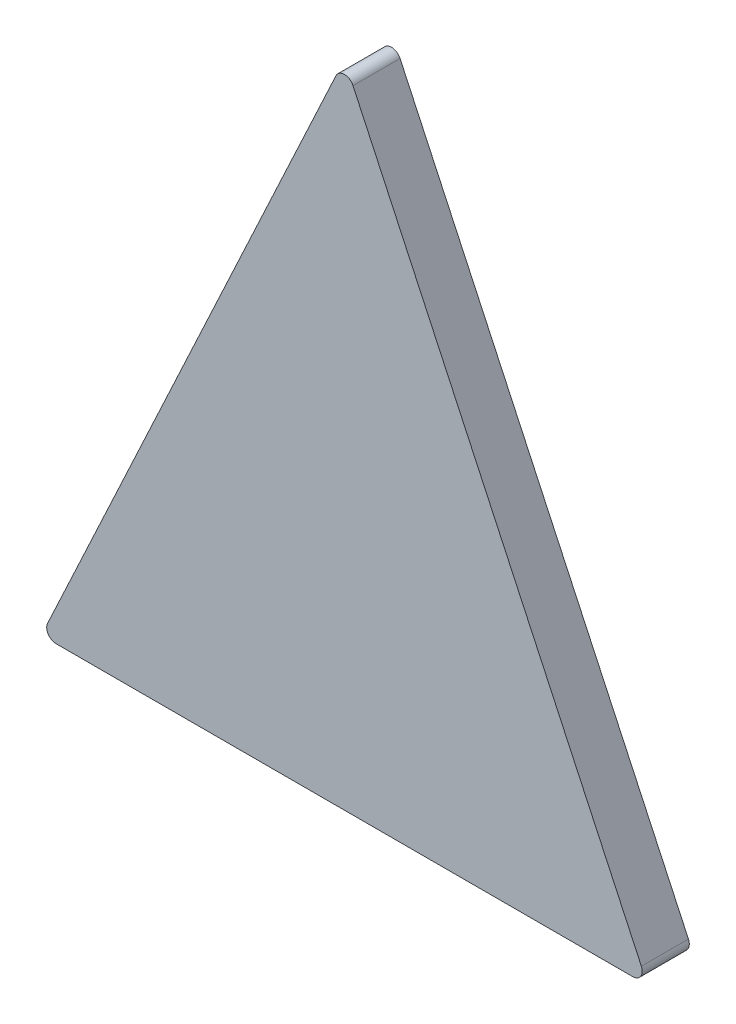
from build123d import *

# Parameters (mm, degrees)
BOSS_EXTRUDE1_DEPTH = 5
FILLET1_R           = 1


with BuildPart() as part:
    # Sketch1 → Boss-Extrude1 (new body)
    with BuildSketch(Plane.XY):
        Polygon((0, 0), (64.407023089, 0), (32.203511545, 69.060653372), align=None)
    extrude(amount=BOSS_EXTRUDE1_DEPTH)

    # Fillet1
    fillet1_edges = [part.edges().sort_by_distance(p)[0] for p in [
        (32.203511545, 69.060653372, 2.5),
        (64.407023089, 0, 2.5),
        (0, 0, 2.5),
    ]]
    fillet(fillet1_edges, radius=FILLET1_R)


solid = part.part
